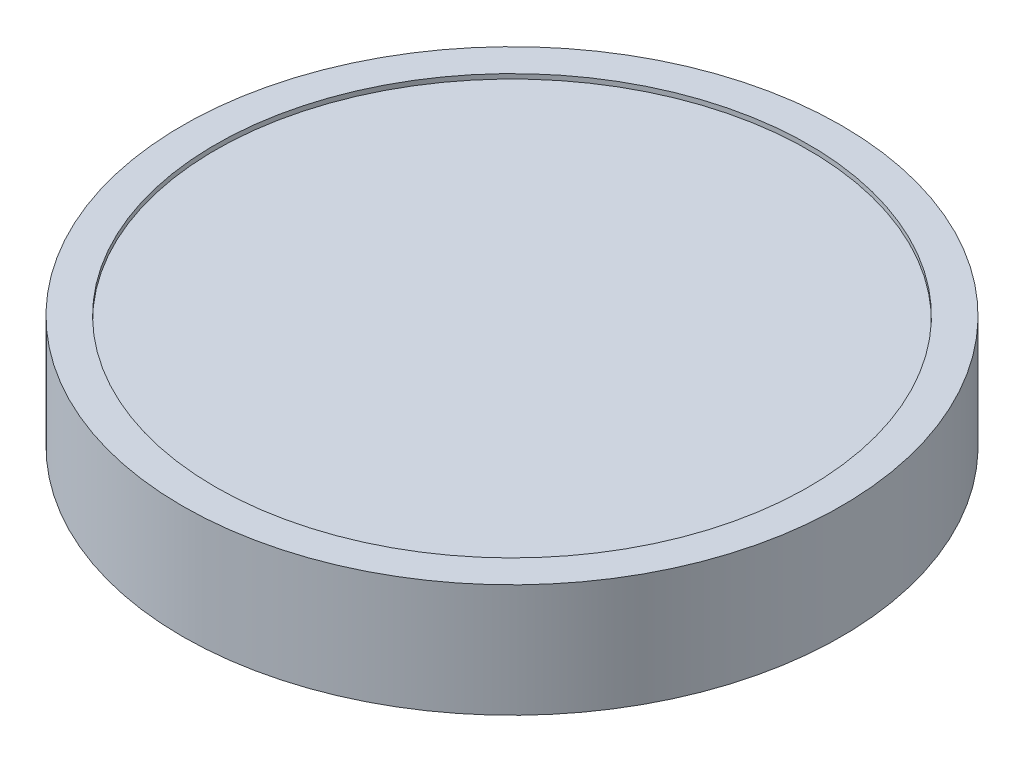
ISO-10303-21;
HEADER;
FILE_DESCRIPTION(('STEP AP214'),'2;1');
FILE_NAME('part.step','',(''),(''),'','','');
FILE_SCHEMA(('AUTOMOTIVE_DESIGN { 1 0 10303 214 1 1 1 1 }'));
ENDSEC;
DATA;
#1=APPLICATION_CONTEXT('core data for automotive mechanical design processes');
#2=APPLICATION_PROTOCOL_DEFINITION('international standard','automotive_design',2000,#1);
#3=PRODUCT_CONTEXT('',#1,'mechanical');
#4=PRODUCT('Part','Part','',(#3));
#5=PRODUCT_RELATED_PRODUCT_CATEGORY('part','',(#4));
#6=PRODUCT_DEFINITION_FORMATION('','',#4);
#7=PRODUCT_DEFINITION_CONTEXT('part definition',#1,'design');
#8=PRODUCT_DEFINITION('design','',#6,#7);
#9=PRODUCT_DEFINITION_SHAPE('','',#8);
#10=(LENGTH_UNIT() NAMED_UNIT(*) SI_UNIT(.MILLI.,.METRE.));
#11=(NAMED_UNIT(*) PLANE_ANGLE_UNIT() SI_UNIT($,.RADIAN.));
#12=(NAMED_UNIT(*) SI_UNIT($,.STERADIAN.) SOLID_ANGLE_UNIT());
#13=UNCERTAINTY_MEASURE_WITH_UNIT(LENGTH_MEASURE(1.E-05),#10,'distance_accuracy_value','');
#14=(GEOMETRIC_REPRESENTATION_CONTEXT(3) GLOBAL_UNCERTAINTY_ASSIGNED_CONTEXT((#13)) GLOBAL_UNIT_ASSIGNED_CONTEXT((#10,
#11,#12)) REPRESENTATION_CONTEXT('',''));
#15=CARTESIAN_POINT('',(0.,0.,0.));
#16=DIRECTION('',(0.,0.,1.));
#17=DIRECTION('',(1.,0.,0.));
#18=AXIS2_PLACEMENT_3D('',#15,#16,#17);
#19=CARTESIAN_POINT('',(0.,24.,0.));
#20=DIRECTION('',(0.,-1.,0.));
#21=DIRECTION('',(0.,0.,-1.));
#22=AXIS2_PLACEMENT_3D('',#19,#20,#21);
#23=CYLINDRICAL_SURFACE('',#22,70.);
#24=CARTESIAN_POINT('',(0.,24.,0.));
#25=DIRECTION('',(0.,1.,0.));
#26=DIRECTION('',(0.,0.,1.));
#27=AXIS2_PLACEMENT_3D('',#24,#25,#26);
#28=CIRCLE('',#27,70.);
#29=CARTESIAN_POINT('',(0.,24.,70.));
#30=VERTEX_POINT('',#29);
#31=EDGE_CURVE('E10',#30,#30,#28,.T.);
#32=ORIENTED_EDGE('',*,*,#31,.F.);
#33=EDGE_LOOP('',(#32));
#34=FACE_BOUND('',#33,.T.);
#35=CARTESIAN_POINT('',(0.,0.,0.));
#36=DIRECTION('',(0.,1.,0.));
#37=DIRECTION('',(0.,0.,1.));
#38=AXIS2_PLACEMENT_3D('',#35,#36,#37);
#39=CIRCLE('',#38,70.);
#40=CARTESIAN_POINT('',(0.,0.,70.));
#41=VERTEX_POINT('',#40);
#42=EDGE_CURVE('E40',#41,#41,#39,.T.);
#43=ORIENTED_EDGE('',*,*,#42,.T.);
#44=EDGE_LOOP('',(#43));
#45=FACE_BOUND('',#44,.T.);
#46=ADVANCED_FACE('F37',(#34,#45),#23,.T.);
#47=CARTESIAN_POINT('',(0.,24.,0.));
#48=DIRECTION('',(0.,1.,0.));
#49=DIRECTION('',(0.,0.,1.));
#50=AXIS2_PLACEMENT_3D('',#47,#48,#49);
#51=PLANE('',#50);
#52=CARTESIAN_POINT('',(0.,24.,0.));
#53=DIRECTION('',(0.,1.,0.));
#54=DIRECTION('',(0.,0.,1.));
#55=AXIS2_PLACEMENT_3D('',#52,#53,#54);
#56=CIRCLE('',#55,63.);
#57=CARTESIAN_POINT('',(0.,24.,63.));
#58=VERTEX_POINT('',#57);
#59=EDGE_CURVE('E51',#58,#58,#56,.T.);
#60=ORIENTED_EDGE('',*,*,#59,.F.);
#61=EDGE_LOOP('',(#60));
#62=FACE_BOUND('',#61,.T.);
#63=ORIENTED_EDGE('',*,*,#31,.T.);
#64=EDGE_LOOP('',(#63));
#65=FACE_BOUND('',#64,.T.);
#66=ADVANCED_FACE('F68',(#62,#65),#51,.T.);
#67=CARTESIAN_POINT('',(0.,0.,0.));
#68=DIRECTION('',(0.,1.,0.));
#69=DIRECTION('',(0.,0.,1.));
#70=AXIS2_PLACEMENT_3D('',#67,#68,#69);
#71=PLANE('',#70);
#72=ORIENTED_EDGE('',*,*,#42,.F.);
#73=EDGE_LOOP('',(#72));
#74=FACE_BOUND('',#73,.T.);
#75=ADVANCED_FACE('F64',(#74),#71,.F.);
#76=CARTESIAN_POINT('',(0.,23.,0.));
#77=DIRECTION('',(0.,1.,0.));
#78=DIRECTION('',(0.,0.,1.));
#79=AXIS2_PLACEMENT_3D('',#76,#77,#78);
#80=CYLINDRICAL_SURFACE('',#79,63.);
#81=CARTESIAN_POINT('',(0.,23.,0.));
#82=DIRECTION('',(0.,1.,0.));
#83=DIRECTION('',(0.,0.,1.));
#84=AXIS2_PLACEMENT_3D('',#81,#82,#83);
#85=CIRCLE('',#84,63.);
#86=CARTESIAN_POINT('',(0.,23.,63.));
#87=VERTEX_POINT('',#86);
#88=EDGE_CURVE('E49',#87,#87,#85,.T.);
#89=ORIENTED_EDGE('',*,*,#88,.F.);
#90=EDGE_LOOP('',(#89));
#91=FACE_BOUND('',#90,.T.);
#92=ORIENTED_EDGE('',*,*,#59,.T.);
#93=EDGE_LOOP('',(#92));
#94=FACE_BOUND('',#93,.T.);
#95=ADVANCED_FACE('F61',(#91,#94),#80,.F.);
#96=CARTESIAN_POINT('',(0.,23.,0.));
#97=DIRECTION('',(0.,1.,0.));
#98=DIRECTION('',(0.,0.,1.));
#99=AXIS2_PLACEMENT_3D('',#96,#97,#98);
#100=PLANE('',#99);
#101=ORIENTED_EDGE('',*,*,#88,.T.);
#102=EDGE_LOOP('',(#101));
#103=FACE_BOUND('',#102,.T.);
#104=ADVANCED_FACE('F59',(#103),#100,.T.);
#105=CLOSED_SHELL('',(#46,#66,#75,#95,#104));
#106=MANIFOLD_SOLID_BREP('B2',#105);
#107=ADVANCED_BREP_SHAPE_REPRESENTATION('',(#18,#106),#14);
#108=SHAPE_DEFINITION_REPRESENTATION(#9,#107);
ENDSEC;
END-ISO-10303-21;
